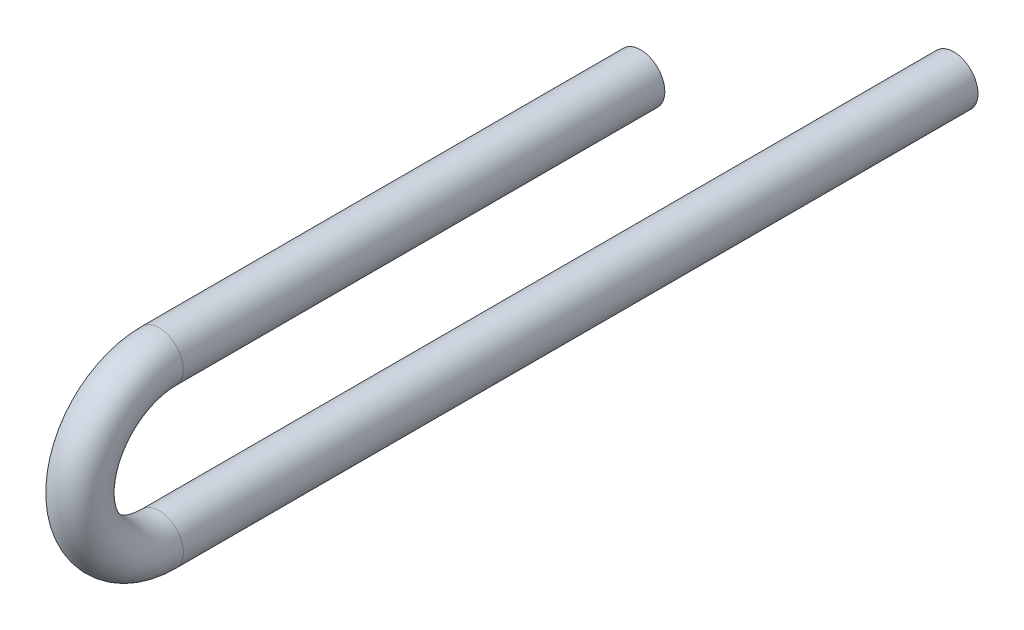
ISO-10303-21;
HEADER;
FILE_DESCRIPTION(('STEP AP214'),'2;1');
FILE_NAME('part.step','',(''),(''),'','','');
FILE_SCHEMA(('AUTOMOTIVE_DESIGN { 1 0 10303 214 1 1 1 1 }'));
ENDSEC;
DATA;
#1=APPLICATION_CONTEXT('core data for automotive mechanical design processes');
#2=APPLICATION_PROTOCOL_DEFINITION('international standard','automotive_design',2000,#1);
#3=PRODUCT_CONTEXT('',#1,'mechanical');
#4=PRODUCT('Part','Part','',(#3));
#5=PRODUCT_RELATED_PRODUCT_CATEGORY('part','',(#4));
#6=PRODUCT_DEFINITION_FORMATION('','',#4);
#7=PRODUCT_DEFINITION_CONTEXT('part definition',#1,'design');
#8=PRODUCT_DEFINITION('design','',#6,#7);
#9=PRODUCT_DEFINITION_SHAPE('','',#8);
#10=(LENGTH_UNIT() NAMED_UNIT(*) SI_UNIT(.MILLI.,.METRE.));
#11=(NAMED_UNIT(*) PLANE_ANGLE_UNIT() SI_UNIT($,.RADIAN.));
#12=(NAMED_UNIT(*) SI_UNIT($,.STERADIAN.) SOLID_ANGLE_UNIT());
#13=UNCERTAINTY_MEASURE_WITH_UNIT(LENGTH_MEASURE(1.E-05),#10,'distance_accuracy_value','');
#14=(GEOMETRIC_REPRESENTATION_CONTEXT(3) GLOBAL_UNCERTAINTY_ASSIGNED_CONTEXT((#13)) GLOBAL_UNIT_ASSIGNED_CONTEXT((#10,
#11,#12)) REPRESENTATION_CONTEXT('',''));
#15=CARTESIAN_POINT('',(0.,0.,0.));
#16=DIRECTION('',(0.,0.,1.));
#17=DIRECTION('',(1.,0.,0.));
#18=AXIS2_PLACEMENT_3D('',#15,#16,#17);
#19=CARTESIAN_POINT('',(0.,0.,12.7));
#20=DIRECTION('',(0.,0.,-1.));
#21=DIRECTION('',(-1.,0.,0.));
#22=AXIS2_PLACEMENT_3D('',#19,#20,#21);
#23=CYLINDRICAL_SURFACE('',#22,0.761999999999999);
#24=CARTESIAN_POINT('',(0.,0.,0.));
#25=DIRECTION('',(0.,0.,1.));
#26=DIRECTION('',(1.,0.,0.));
#27=AXIS2_PLACEMENT_3D('',#24,#25,#26);
#28=CIRCLE('',#27,0.761999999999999);
#29=CARTESIAN_POINT('',(0.762000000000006,0.,0.));
#30=VERTEX_POINT('',#29);
#31=EDGE_CURVE('E10',#30,#30,#28,.T.);
#32=ORIENTED_EDGE('',*,*,#31,.T.);
#33=EDGE_LOOP('',(#32));
#34=FACE_BOUND('',#33,.T.);
#35=CARTESIAN_POINT('',(0.,0.,15.1870610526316));
#36=DIRECTION('',(0.,0.,1.));
#37=DIRECTION('',(1.,0.,0.));
#38=AXIS2_PLACEMENT_3D('',#35,#36,#37);
#39=CIRCLE('',#38,0.761999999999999);
#40=CARTESIAN_POINT('',(0.,0.762000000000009,15.1870610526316));
#41=VERTEX_POINT('',#40);
#42=EDGE_CURVE('E45',#41,#41,#39,.T.);
#43=ORIENTED_EDGE('',*,*,#42,.F.);
#44=EDGE_LOOP('',(#43));
#45=FACE_BOUND('',#44,.T.);
#46=ADVANCED_FACE('F31',(#34,#45),#23,.T.);
#47=CARTESIAN_POINT('',(0.,0.,0.));
#48=DIRECTION('',(0.,0.,1.));
#49=DIRECTION('',(1.,0.,0.));
#50=AXIS2_PLACEMENT_3D('',#47,#48,#49);
#51=PLANE('',#50);
#52=ORIENTED_EDGE('',*,*,#31,.F.);
#53=EDGE_LOOP('',(#52));
#54=FACE_BOUND('',#53,.T.);
#55=ADVANCED_FACE('F55',(#54),#51,.F.);
#56=CARTESIAN_POINT('',(0.,-4.99497684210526,15.1870610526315));
#57=DIRECTION('',(0.,0.,-1.));
#58=DIRECTION('',(-1.,0.,0.));
#59=AXIS2_PLACEMENT_3D('',#56,#57,#58);
#60=CYLINDRICAL_SURFACE('',#59,0.761999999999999);
#61=CARTESIAN_POINT('',(0.,-4.99497684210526,15.1870610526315));
#62=DIRECTION('',(0.,0.,-1.));
#63=DIRECTION('',(1.,0.,0.));
#64=AXIS2_PLACEMENT_3D('',#61,#62,#63);
#65=CIRCLE('',#64,0.761999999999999);
#66=CARTESIAN_POINT('',(0.,-5.75697684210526,15.1870610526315));
#67=VERTEX_POINT('',#66);
#68=EDGE_CURVE('E41',#67,#67,#65,.T.);
#69=ORIENTED_EDGE('',*,*,#68,.T.);
#70=EDGE_LOOP('',(#69));
#71=FACE_BOUND('',#70,.T.);
#72=CARTESIAN_POINT('',(0.,-4.99497684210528,-9.87819368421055));
#73=DIRECTION('',(0.,0.,-1.));
#74=DIRECTION('',(1.,0.,0.));
#75=AXIS2_PLACEMENT_3D('',#72,#73,#74);
#76=CIRCLE('',#75,0.761999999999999);
#77=CARTESIAN_POINT('',(0.762000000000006,-4.99497684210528,-9.87819368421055));
#78=VERTEX_POINT('',#77);
#79=EDGE_CURVE('E37',#78,#78,#76,.T.);
#80=ORIENTED_EDGE('',*,*,#79,.F.);
#81=EDGE_LOOP('',(#80));
#82=FACE_BOUND('',#81,.T.);
#83=ADVANCED_FACE('F59',(#71,#82),#60,.T.);
#84=CARTESIAN_POINT('',(0.,-2.49748842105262,15.1870610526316));
#85=DIRECTION('',(1.,0.,0.));
#86=DIRECTION('',(0.,0.,-1.));
#87=AXIS2_PLACEMENT_3D('',#84,#85,#86);
#88=TOROIDAL_SURFACE('',#87,2.49748842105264,0.761999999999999);
#89=CARTESIAN_POINT('',(0.,-2.49748842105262,15.1870610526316));
#90=DIRECTION('',(1.,0.,0.));
#91=DIRECTION('',(0.,0.,-1.));
#92=AXIS2_PLACEMENT_3D('',#89,#90,#91);
#93=CIRCLE('',#92,3.25948842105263);
#94=EDGE_CURVE('',#41,#67,#93,.T.);
#95=ORIENTED_EDGE('',*,*,#42,.T.);
#96=ORIENTED_EDGE('',*,*,#68,.F.);
#97=ORIENTED_EDGE('',*,*,#94,.T.);
#98=ORIENTED_EDGE('',*,*,#94,.F.);
#99=EDGE_LOOP('',(#95,#97,#96,#98));
#100=FACE_BOUND('',#99,.T.);
#101=ADVANCED_FACE('F51',(#100),#88,.T.);
#102=CARTESIAN_POINT('',(0.,-4.99497684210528,-9.87819368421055));
#103=DIRECTION('',(0.,0.,-1.));
#104=DIRECTION('',(1.,0.,0.));
#105=AXIS2_PLACEMENT_3D('',#102,#103,#104);
#106=PLANE('',#105);
#107=ORIENTED_EDGE('',*,*,#79,.T.);
#108=EDGE_LOOP('',(#107));
#109=FACE_BOUND('',#108,.T.);
#110=ADVANCED_FACE('F69',(#109),#106,.T.);
#111=CLOSED_SHELL('',(#46,#55,#83,#101,#110));
#112=MANIFOLD_SOLID_BREP('B2',#111);
#113=ADVANCED_BREP_SHAPE_REPRESENTATION('',(#18,#112),#14);
#114=SHAPE_DEFINITION_REPRESENTATION(#9,#113);
ENDSEC;
END-ISO-10303-21;
